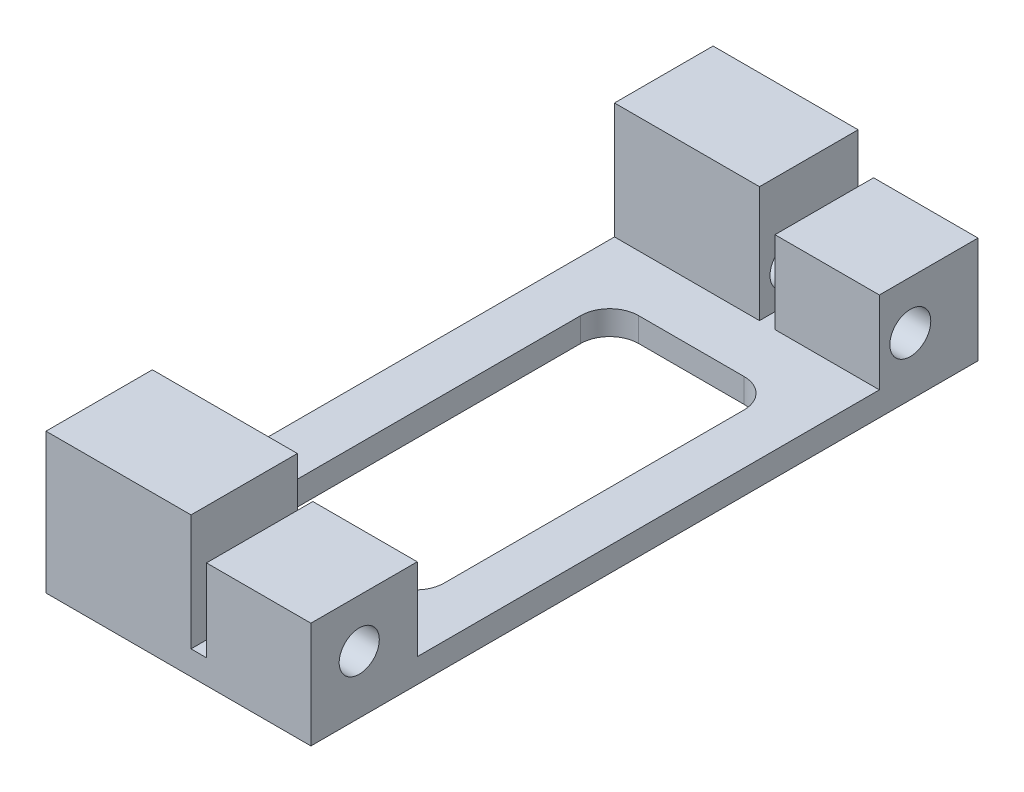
from build123d import *

# Parameters (mm, degrees)
SKETCH1_W           = 27.4
SKETCH1_H           = 69
BOSS_EXTRUDE1_DEPTH = 2.5
SKETCH2_W           = 15
SKETCH2_H           = 10.2
SKETCH2_H_2         = 11
BOSS_EXTRUDE2_DEPTH = 11
SKETCH2_2_W         = 15
SKETCH2_2_H         = 10.2
SKETCH2_2_H_2       = 11
BOSS_EXTRUDE3_DEPTH = 12
SKETCH4_W           = 10.8
SKETCH4_H           = 10.2
SKETCH4_H_2         = 11
BOSS_EXTRUDE4_DEPTH = 8.5
SKETCH5_R           = 2.074357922
SKETCH5_R_2         = 2.11605773
CUT_EXTRUDE1_DEPTH  = 40


with BuildPart() as part:
    # Sketch1 → Boss-Extrude1 (new body)
    with BuildSketch(Plane(origin=(0, 0, 0), x_dir=(1, 0, 0), z_dir=(0, 1, 0))):
        with Locations((6.2, 1)):
            Rectangle(SKETCH1_W, SKETCH1_H)
        with BuildLine():
            Line((0.8, 19.5), (11.7, 19.5))
            ThreePointArc((11.7, 19.5), (13.821320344, 18.621320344), (14.7, 16.5))
            Line((14.7, 16.5), (14.7, -14.5))
            ThreePointArc((14.7, -14.5), (13.821320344, -16.621320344), (11.7, -17.5))
            Line((11.7, -17.5), (0.8, -17.5))
            ThreePointArc((0.8, -17.5), (-1.321320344, -16.621320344), (-2.2, -14.5))
            Line((-2.2, -14.5), (-2.2, 16.5))
            ThreePointArc((-2.2, 16.5), (-1.321320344, 18.621320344), (0.8, 19.5))
        make_face(mode=Mode.SUBTRACT)
    extrude(amount=-BOSS_EXTRUDE1_DEPTH)

    # Sketch2 → Boss-Extrude2 (add)
    with BuildSketch(Plane(origin=(0, 0, 0), x_dir=(1, 0, 0), z_dir=(0, 1, 0))):
        with Locations((0, 30.4)):
            Rectangle(SKETCH2_W, SKETCH2_H)
        with Locations((0, -28)):
            Rectangle(SKETCH2_W, SKETCH2_H_2)
    extrude(amount=BOSS_EXTRUDE2_DEPTH)

    # Sketch2_2 → Boss-Extrude3 (add)
    with BuildSketch(Plane(origin=(0, 0, 0), x_dir=(1, 0, 0), z_dir=(0, 1, 0))):
        with Locations((0, 30.4)):
            Rectangle(SKETCH2_2_W, SKETCH2_2_H)
        with Locations((0, -28)):
            Rectangle(SKETCH2_2_W, SKETCH2_2_H_2)
    extrude(amount=BOSS_EXTRUDE3_DEPTH)

    # Sketch4 → Boss-Extrude4 (add)
    with BuildSketch(Plane(origin=(0, 0, 0), x_dir=(1, 0, 0), z_dir=(0, 1, 0))):
        with Locations((14.5, 30.4)):
            Rectangle(SKETCH4_W, SKETCH4_H)
        with Locations((14.5, -28)):
            Rectangle(SKETCH4_W, SKETCH4_H_2)
    extrude(amount=BOSS_EXTRUDE4_DEPTH)

    # Sketch5 → Cut-Extrude1 (cut)
    with BuildSketch(Plane(origin=(19.9, 0, 0), x_dir=(0, 0, -1), z_dir=(1, 0, 0))):
        with Locations((-28.5, 3.5)):
            Circle(SKETCH5_R)
        with Locations((28.5, 3.5)):
            Circle(SKETCH5_R_2)
    extrude(amount=-CUT_EXTRUDE1_DEPTH, mode=Mode.SUBTRACT)


solid = part.part
